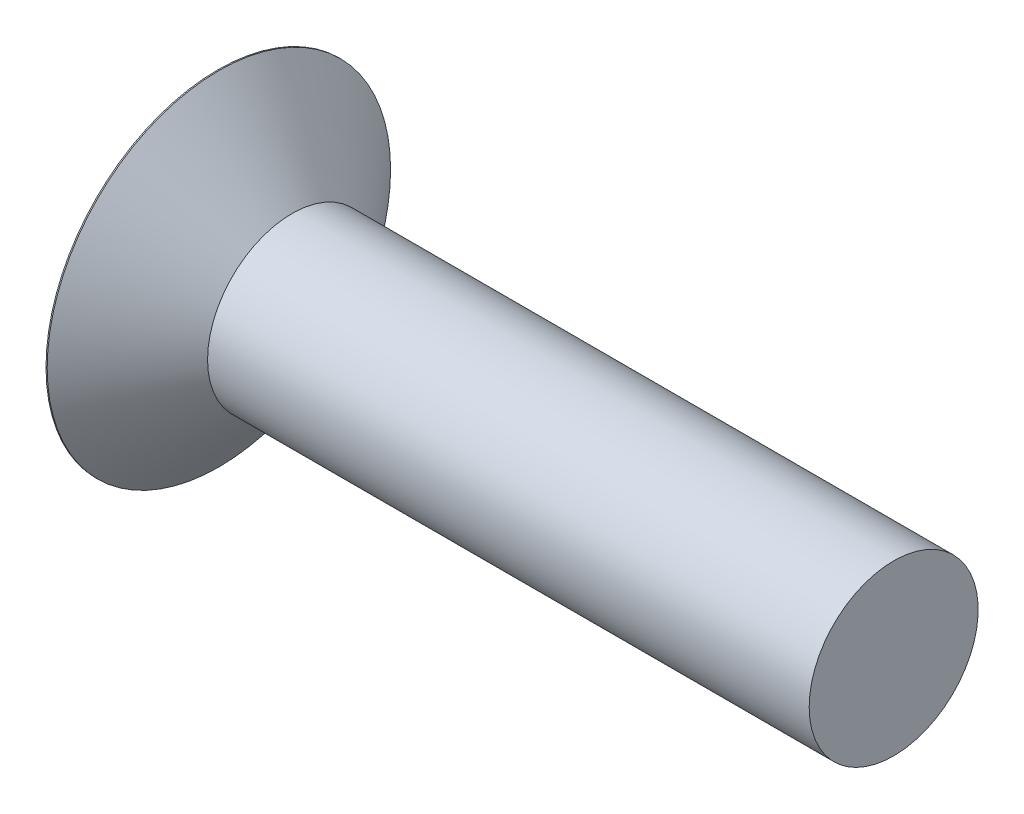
ISO-10303-21;
HEADER;
FILE_DESCRIPTION(('STEP AP214'),'2;1');
FILE_NAME('part.step','',(''),(''),'','','');
FILE_SCHEMA(('AUTOMOTIVE_DESIGN { 1 0 10303 214 1 1 1 1 }'));
ENDSEC;
DATA;
#1=APPLICATION_CONTEXT('core data for automotive mechanical design processes');
#2=APPLICATION_PROTOCOL_DEFINITION('international standard','automotive_design',2000,#1);
#3=PRODUCT_CONTEXT('',#1,'mechanical');
#4=PRODUCT('Part','Part','',(#3));
#5=PRODUCT_RELATED_PRODUCT_CATEGORY('part','',(#4));
#6=PRODUCT_DEFINITION_FORMATION('','',#4);
#7=PRODUCT_DEFINITION_CONTEXT('part definition',#1,'design');
#8=PRODUCT_DEFINITION('design','',#6,#7);
#9=PRODUCT_DEFINITION_SHAPE('','',#8);
#10=(LENGTH_UNIT() NAMED_UNIT(*) SI_UNIT(.MILLI.,.METRE.));
#11=(NAMED_UNIT(*) PLANE_ANGLE_UNIT() SI_UNIT($,.RADIAN.));
#12=(NAMED_UNIT(*) SI_UNIT($,.STERADIAN.) SOLID_ANGLE_UNIT());
#13=UNCERTAINTY_MEASURE_WITH_UNIT(LENGTH_MEASURE(1.E-05),#10,'distance_accuracy_value','');
#14=(GEOMETRIC_REPRESENTATION_CONTEXT(3) GLOBAL_UNCERTAINTY_ASSIGNED_CONTEXT((#13)) GLOBAL_UNIT_ASSIGNED_CONTEXT((#10,
#11,#12)) REPRESENTATION_CONTEXT('',''));
#15=CARTESIAN_POINT('',(0.,0.,0.));
#16=DIRECTION('',(0.,0.,1.));
#17=DIRECTION('',(1.,0.,0.));
#18=AXIS2_PLACEMENT_3D('',#15,#16,#17);
#19=CARTESIAN_POINT('',(0.,0.,0.));
#20=DIRECTION('',(-1.,0.,0.));
#21=DIRECTION('',(0.,0.,1.));
#22=AXIS2_PLACEMENT_3D('',#19,#20,#21);
#23=PLANE('',#22);
#24=CARTESIAN_POINT('',(0.,0.,0.));
#25=DIRECTION('',(-1.,0.,0.));
#26=DIRECTION('',(0.,0.,1.));
#27=AXIS2_PLACEMENT_3D('',#24,#25,#26);
#28=CIRCLE('',#27,9.6774);
#29=CARTESIAN_POINT('',(0.,0.,9.6774));
#30=VERTEX_POINT('',#29);
#31=EDGE_CURVE('E46',#30,#30,#28,.T.);
#32=ORIENTED_EDGE('',*,*,#31,.T.);
#33=EDGE_LOOP('',(#32));
#34=FACE_BOUND('',#33,.T.);
#35=DIRECTION('',(0.,1.,0.));
#36=VECTOR('',#35,1.);
#37=CARTESIAN_POINT('',(0.,-6.6421,-1.0922));
#38=LINE('',#37,#36);
#39=CARTESIAN_POINT('',(0.,-6.6421,-1.0922));
#40=VERTEX_POINT('',#39);
#41=CARTESIAN_POINT('',(0.,-1.0922,-1.0922));
#42=VERTEX_POINT('',#41);
#43=EDGE_CURVE('E107',#40,#42,#38,.T.);
#44=ORIENTED_EDGE('',*,*,#43,.T.);
#45=DIRECTION('',(0.,0.,-1.));
#46=VECTOR('',#45,1.);
#47=CARTESIAN_POINT('',(0.,-1.09220000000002,6.6421));
#48=LINE('',#47,#46);
#49=CARTESIAN_POINT('',(0.,-1.09219999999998,-6.6421));
#50=VERTEX_POINT('',#49);
#51=EDGE_CURVE('E87',#42,#50,#48,.T.);
#52=ORIENTED_EDGE('',*,*,#51,.T.);
#53=DIRECTION('',(0.,1.,0.));
#54=VECTOR('',#53,1.);
#55=CARTESIAN_POINT('',(0.,-1.09219999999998,-6.6421));
#56=LINE('',#55,#54);
#57=CARTESIAN_POINT('',(0.,1.09220000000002,-6.6421));
#58=VERTEX_POINT('',#57);
#59=EDGE_CURVE('E330',#50,#58,#56,.T.);
#60=ORIENTED_EDGE('',*,*,#59,.T.);
#61=DIRECTION('',(0.,0.,1.));
#62=VECTOR('',#61,1.);
#63=CARTESIAN_POINT('',(0.,1.09220000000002,-6.6421));
#64=LINE('',#63,#62);
#65=CARTESIAN_POINT('',(0.,1.0922,-1.0922));
#66=VERTEX_POINT('',#65);
#67=EDGE_CURVE('E103',#58,#66,#64,.T.);
#68=ORIENTED_EDGE('',*,*,#67,.T.);
#69=CARTESIAN_POINT('',(0.,6.6421,-1.0922));
#70=VERTEX_POINT('',#69);
#71=EDGE_CURVE('E97',#66,#70,#38,.T.);
#72=ORIENTED_EDGE('',*,*,#71,.T.);
#73=DIRECTION('',(0.,0.,1.));
#74=VECTOR('',#73,1.);
#75=CARTESIAN_POINT('',(0.,6.6421,-1.0922));
#76=LINE('',#75,#74);
#77=CARTESIAN_POINT('',(0.,6.6421,1.0922));
#78=VERTEX_POINT('',#77);
#79=EDGE_CURVE('E100',#70,#78,#76,.T.);
#80=ORIENTED_EDGE('',*,*,#79,.T.);
#81=DIRECTION('',(0.,-1.,0.));
#82=VECTOR('',#81,1.);
#83=CARTESIAN_POINT('',(0.,6.6421,1.0922));
#84=LINE('',#83,#82);
#85=CARTESIAN_POINT('',(0.,1.0922,1.0922));
#86=VERTEX_POINT('',#85);
#87=EDGE_CURVE('E342',#78,#86,#84,.T.);
#88=ORIENTED_EDGE('',*,*,#87,.T.);
#89=CARTESIAN_POINT('',(0.,1.09219999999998,6.6421));
#90=VERTEX_POINT('',#89);
#91=EDGE_CURVE('E325',#86,#90,#64,.T.);
#92=ORIENTED_EDGE('',*,*,#91,.T.);
#93=DIRECTION('',(0.,-1.,0.));
#94=VECTOR('',#93,1.);
#95=CARTESIAN_POINT('',(0.,1.09219999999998,6.6421));
#96=LINE('',#95,#94);
#97=CARTESIAN_POINT('',(0.,-1.09220000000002,6.6421));
#98=VERTEX_POINT('',#97);
#99=EDGE_CURVE('E311',#90,#98,#96,.T.);
#100=ORIENTED_EDGE('',*,*,#99,.T.);
#101=CARTESIAN_POINT('',(0.,-1.0922,1.0922));
#102=VERTEX_POINT('',#101);
#103=EDGE_CURVE('E323',#98,#102,#48,.T.);
#104=ORIENTED_EDGE('',*,*,#103,.T.);
#105=CARTESIAN_POINT('',(0.,-6.6421,1.0922));
#106=VERTEX_POINT('',#105);
#107=EDGE_CURVE('E113',#102,#106,#84,.T.);
#108=ORIENTED_EDGE('',*,*,#107,.T.);
#109=DIRECTION('',(0.,0.,-1.));
#110=VECTOR('',#109,1.);
#111=CARTESIAN_POINT('',(0.,-6.6421,1.0922));
#112=LINE('',#111,#110);
#113=EDGE_CURVE('E136',#106,#40,#112,.T.);
#114=ORIENTED_EDGE('',*,*,#113,.T.);
#115=EDGE_LOOP('',(#44,#52,#60,#68,#72,#80,#88,#92,#100,#104,#108,#114));
#116=FACE_BOUND('',#115,.T.);
#117=ADVANCED_FACE('F39',(#34,#116),#23,.T.);
#118=CARTESIAN_POINT('',(8.69008083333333,0.,0.497178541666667));
#119=DIRECTION('',(-0.0683113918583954,0.,-0.997664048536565));
#120=DIRECTION('',(-0.997664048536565,0.,0.0683113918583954));
#121=AXIS2_PLACEMENT_3D('',#118,#119,#120);
#122=PLANE('',#121);
#123=ORIENTED_EDGE('',*,*,#107,.F.);
#124=DIRECTION('',(0.995344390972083,0.0681525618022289,-0.0681525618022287));
#125=VECTOR('',#124,1.);
#126=CARTESIAN_POINT('',(8.72380707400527,-0.494869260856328,0.494869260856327));
#127=LINE('',#126,#125);
#128=CARTESIAN_POINT('',(7.9756,-0.546100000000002,0.546099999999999));
#129=VERTEX_POINT('',#128);
#130=EDGE_CURVE('E131',#102,#129,#127,.T.);
#131=ORIENTED_EDGE('',*,*,#130,.T.);
#132=DIRECTION('',(0.793328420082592,0.606365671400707,-0.0543202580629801));
#133=VECTOR('',#132,1.);
#134=CARTESIAN_POINT('',(0.,-6.6421,1.0922));
#135=LINE('',#134,#133);
#136=EDGE_CURVE('E108',#106,#129,#135,.T.);
#137=ORIENTED_EDGE('',*,*,#136,.F.);
#138=EDGE_LOOP('',(#123,#131,#137));
#139=FACE_BOUND('',#138,.T.);
#140=ADVANCED_FACE('F159',(#139),#122,.T.);
#141=DIRECTION('',(0.793328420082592,-0.606365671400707,-0.05432025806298));
#142=VECTOR('',#141,1.);
#143=CARTESIAN_POINT('',(0.,6.6421,1.0922));
#144=LINE('',#143,#142);
#145=CARTESIAN_POINT('',(7.9756,0.546100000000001,0.5461));
#146=VERTEX_POINT('',#145);
#147=EDGE_CURVE('E53',#78,#146,#144,.T.);
#148=ORIENTED_EDGE('',*,*,#147,.T.);
#149=DIRECTION('',(-0.995344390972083,0.0681525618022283,0.0681525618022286));
#150=VECTOR('',#149,1.);
#151=CARTESIAN_POINT('',(8.72380707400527,0.494869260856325,0.494869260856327));
#152=LINE('',#151,#150);
#153=EDGE_CURVE('E338',#146,#86,#152,.T.);
#154=ORIENTED_EDGE('',*,*,#153,.T.);
#155=ORIENTED_EDGE('',*,*,#87,.F.);
#156=EDGE_LOOP('',(#148,#154,#155));
#157=FACE_BOUND('',#156,.T.);
#158=ADVANCED_FACE('F164',(#157),#122,.T.);
#159=CARTESIAN_POINT('',(8.69008083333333,0.,-0.497178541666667));
#160=DIRECTION('',(-0.0683113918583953,0.,0.997664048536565));
#161=DIRECTION('',(0.997664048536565,0.,0.0683113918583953));
#162=AXIS2_PLACEMENT_3D('',#159,#160,#161);
#163=PLANE('',#162);
#164=DIRECTION('',(0.793328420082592,0.606365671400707,0.0543202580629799));
#165=VECTOR('',#164,1.);
#166=CARTESIAN_POINT('',(0.,-6.6421,-1.0922));
#167=LINE('',#166,#165);
#168=CARTESIAN_POINT('',(7.9756,-0.546099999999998,-0.546100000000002));
#169=VERTEX_POINT('',#168);
#170=EDGE_CURVE('E62',#40,#169,#167,.T.);
#171=ORIENTED_EDGE('',*,*,#170,.T.);
#172=DIRECTION('',(-0.995344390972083,-0.0681525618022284,-0.0681525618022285));
#173=VECTOR('',#172,1.);
#174=CARTESIAN_POINT('',(8.72380707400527,-0.494869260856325,-0.494869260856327));
#175=LINE('',#174,#173);
#176=EDGE_CURVE('E11',#169,#42,#175,.T.);
#177=ORIENTED_EDGE('',*,*,#176,.T.);
#178=ORIENTED_EDGE('',*,*,#43,.F.);
#179=EDGE_LOOP('',(#171,#177,#178));
#180=FACE_BOUND('',#179,.T.);
#181=ADVANCED_FACE('F156',(#180),#163,.T.);
#182=ORIENTED_EDGE('',*,*,#71,.F.);
#183=DIRECTION('',(0.995344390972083,-0.0681525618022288,0.0681525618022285));
#184=VECTOR('',#183,1.);
#185=CARTESIAN_POINT('',(8.72380707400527,0.494869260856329,-0.494869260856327));
#186=LINE('',#185,#184);
#187=CARTESIAN_POINT('',(7.9756,0.546100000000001,-0.5461));
#188=VERTEX_POINT('',#187);
#189=EDGE_CURVE('E116',#66,#188,#186,.T.);
#190=ORIENTED_EDGE('',*,*,#189,.T.);
#191=DIRECTION('',(0.793328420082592,-0.606365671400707,0.0543202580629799));
#192=VECTOR('',#191,1.);
#193=CARTESIAN_POINT('',(0.,6.6421,-1.0922));
#194=LINE('',#193,#192);
#195=EDGE_CURVE('E112',#70,#188,#194,.T.);
#196=ORIENTED_EDGE('',*,*,#195,.F.);
#197=EDGE_LOOP('',(#182,#190,#196));
#198=FACE_BOUND('',#197,.T.);
#199=ADVANCED_FACE('F115',(#198),#163,.T.);
#200=CARTESIAN_POINT('',(-6.34999999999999,0.,0.));
#201=DIRECTION('',(-1.,0.,0.));
#202=DIRECTION('',(0.,0.,1.));
#203=AXIS2_PLACEMENT_3D('',#200,#201,#202);
#204=CYLINDRICAL_SURFACE('',#203,9.6774);
#205=CARTESIAN_POINT('',(0.0669092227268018,0.,0.));
#206=DIRECTION('',(-1.,0.,0.));
#207=DIRECTION('',(0.,0.,1.));
#208=AXIS2_PLACEMENT_3D('',#205,#206,#207);
#209=CIRCLE('',#208,9.6774);
#210=CARTESIAN_POINT('',(0.0669092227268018,0.,9.6774));
#211=VERTEX_POINT('',#210);
#212=EDGE_CURVE('E139',#211,#211,#209,.T.);
#213=ORIENTED_EDGE('',*,*,#212,.T.);
#214=EDGE_LOOP('',(#213));
#215=FACE_BOUND('',#214,.T.);
#216=ORIENTED_EDGE('',*,*,#31,.F.);
#217=EDGE_LOOP('',(#216));
#218=FACE_BOUND('',#217,.T.);
#219=ADVANCED_FACE('F145',(#215,#218),#204,.T.);
#220=CARTESIAN_POINT('',(0.0669092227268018,0.,0.));
#221=DIRECTION('',(-1.,0.,0.));
#222=DIRECTION('',(0.,0.,1.));
#223=AXIS2_PLACEMENT_3D('',#220,#221,#222);
#224=CONICAL_SURFACE('',#223,9.6774,0.872664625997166);
#225=CARTESIAN_POINT('',(4.191,0.,0.));
#226=DIRECTION('',(-1.,0.,0.));
#227=DIRECTION('',(0.,0.,1.));
#228=AXIS2_PLACEMENT_3D('',#225,#226,#227);
#229=CIRCLE('',#228,4.7625);
#230=CARTESIAN_POINT('',(4.191,0.,4.7625));
#231=VERTEX_POINT('',#230);
#232=EDGE_CURVE('E135',#231,#231,#229,.T.);
#233=ORIENTED_EDGE('',*,*,#232,.T.);
#234=EDGE_LOOP('',(#233));
#235=FACE_BOUND('',#234,.T.);
#236=ORIENTED_EDGE('',*,*,#212,.F.);
#237=EDGE_LOOP('',(#236));
#238=FACE_BOUND('',#237,.T.);
#239=ADVANCED_FACE('F147',(#235,#238),#224,.T.);
#240=CARTESIAN_POINT('',(-6.34999999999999,0.,0.));
#241=DIRECTION('',(-1.,0.,0.));
#242=DIRECTION('',(0.,0.,1.));
#243=AXIS2_PLACEMENT_3D('',#240,#241,#242);
#244=CYLINDRICAL_SURFACE('',#243,4.7625);
#245=CARTESIAN_POINT('',(38.1,0.,0.));
#246=DIRECTION('',(-1.,0.,0.));
#247=DIRECTION('',(0.,0.,1.));
#248=AXIS2_PLACEMENT_3D('',#245,#246,#247);
#249=CIRCLE('',#248,4.7625);
#250=CARTESIAN_POINT('',(38.1,0.,4.7625));
#251=VERTEX_POINT('',#250);
#252=EDGE_CURVE('E132',#251,#251,#249,.T.);
#253=ORIENTED_EDGE('',*,*,#252,.T.);
#254=EDGE_LOOP('',(#253));
#255=FACE_BOUND('',#254,.T.);
#256=ORIENTED_EDGE('',*,*,#232,.F.);
#257=EDGE_LOOP('',(#256));
#258=FACE_BOUND('',#257,.T.);
#259=ADVANCED_FACE('F152',(#255,#258),#244,.T.);
#260=CARTESIAN_POINT('',(38.1,4.7625,0.));
#261=DIRECTION('',(1.,0.,0.));
#262=DIRECTION('',(0.,0.,-1.));
#263=AXIS2_PLACEMENT_3D('',#260,#261,#262);
#264=PLANE('',#263);
#265=ORIENTED_EDGE('',*,*,#252,.F.);
#266=EDGE_LOOP('',(#265));
#267=FACE_BOUND('',#266,.T.);
#268=ADVANCED_FACE('F184',(#267),#264,.T.);
#269=CARTESIAN_POINT('',(7.9756,0.5461,-0.5461));
#270=DIRECTION('',(1.,0.,0.));
#271=DIRECTION('',(0.,0.,-1.));
#272=AXIS2_PLACEMENT_3D('',#269,#270,#271);
#273=PLANE('',#272);
#274=DIRECTION('',(0.,1.,0.));
#275=VECTOR('',#274,1.);
#276=CARTESIAN_POINT('',(7.9756,-0.5461,-0.5461));
#277=LINE('',#276,#275);
#278=EDGE_CURVE('E127',#169,#188,#277,.T.);
#279=ORIENTED_EDGE('',*,*,#278,.F.);
#280=DIRECTION('',(0.,0.,-1.));
#281=VECTOR('',#280,1.);
#282=CARTESIAN_POINT('',(7.9756,-0.5461,0.5461));
#283=LINE('',#282,#281);
#284=EDGE_CURVE('E118',#129,#169,#283,.T.);
#285=ORIENTED_EDGE('',*,*,#284,.F.);
#286=DIRECTION('',(0.,-1.,0.));
#287=VECTOR('',#286,1.);
#288=CARTESIAN_POINT('',(7.9756,0.5461,0.5461));
#289=LINE('',#288,#287);
#290=EDGE_CURVE('E121',#146,#129,#289,.T.);
#291=ORIENTED_EDGE('',*,*,#290,.F.);
#292=DIRECTION('',(0.,0.,1.));
#293=VECTOR('',#292,1.);
#294=CARTESIAN_POINT('',(7.9756,0.5461,-0.5461));
#295=LINE('',#294,#293);
#296=EDGE_CURVE('E125',#188,#146,#295,.T.);
#297=ORIENTED_EDGE('',*,*,#296,.F.);
#298=EDGE_LOOP('',(#279,#285,#291,#297));
#299=FACE_BOUND('',#298,.T.);
#300=ADVANCED_FACE('F181',(#299),#273,.F.);
#301=CARTESIAN_POINT('',(7.9756,-0.5461,-0.5461));
#302=DIRECTION('',(-0.607262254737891,0.794501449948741,0.));
#303=DIRECTION('',(-0.794501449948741,-0.607262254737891,0.));
#304=AXIS2_PLACEMENT_3D('',#301,#302,#303);
#305=PLANE('',#304);
#306=ORIENTED_EDGE('',*,*,#170,.F.);
#307=ORIENTED_EDGE('',*,*,#113,.F.);
#308=ORIENTED_EDGE('',*,*,#136,.T.);
#309=ORIENTED_EDGE('',*,*,#284,.T.);
#310=EDGE_LOOP('',(#306,#307,#308,#309));
#311=FACE_BOUND('',#310,.T.);
#312=ADVANCED_FACE('F173',(#311),#305,.T.);
#313=CARTESIAN_POINT('',(7.9756,0.5461,0.5461));
#314=DIRECTION('',(-0.607262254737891,-0.794501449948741,0.));
#315=DIRECTION('',(0.794501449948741,-0.607262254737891,0.));
#316=AXIS2_PLACEMENT_3D('',#313,#314,#315);
#317=PLANE('',#316);
#318=ORIENTED_EDGE('',*,*,#147,.F.);
#319=ORIENTED_EDGE('',*,*,#79,.F.);
#320=ORIENTED_EDGE('',*,*,#195,.T.);
#321=ORIENTED_EDGE('',*,*,#296,.T.);
#322=EDGE_LOOP('',(#318,#319,#320,#321));
#323=FACE_BOUND('',#322,.T.);
#324=ADVANCED_FACE('F111',(#323),#317,.T.);
#325=CARTESIAN_POINT('',(8.69008083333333,-0.497178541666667,0.));
#326=DIRECTION('',(-0.0683113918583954,0.997664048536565,0.));
#327=DIRECTION('',(-0.997664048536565,-0.0683113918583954,0.));
#328=AXIS2_PLACEMENT_3D('',#325,#326,#327);
#329=PLANE('',#328);
#330=DIRECTION('',(0.793328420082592,0.054320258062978,0.606365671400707));
#331=VECTOR('',#330,1.);
#332=CARTESIAN_POINT('',(0.,-1.09219999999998,-6.6421));
#333=LINE('',#332,#331);
#334=EDGE_CURVE('E332',#50,#169,#333,.T.);
#335=ORIENTED_EDGE('',*,*,#334,.F.);
#336=ORIENTED_EDGE('',*,*,#51,.F.);
#337=ORIENTED_EDGE('',*,*,#176,.F.);
#338=EDGE_LOOP('',(#335,#336,#337));
#339=FACE_BOUND('',#338,.T.);
#340=ADVANCED_FACE('F180',(#339),#329,.T.);
#341=CARTESIAN_POINT('',(8.69008083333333,0.497178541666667,0.));
#342=DIRECTION('',(-0.0683113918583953,-0.997664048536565,0.));
#343=DIRECTION('',(0.997664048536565,-0.0683113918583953,0.));
#344=AXIS2_PLACEMENT_3D('',#341,#342,#343);
#345=PLANE('',#344);
#346=ORIENTED_EDGE('',*,*,#67,.F.);
#347=DIRECTION('',(0.793328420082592,-0.0543202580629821,0.606365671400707));
#348=VECTOR('',#347,1.);
#349=CARTESIAN_POINT('',(0.,1.09220000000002,-6.6421));
#350=LINE('',#349,#348);
#351=EDGE_CURVE('E78',#58,#188,#350,.T.);
#352=ORIENTED_EDGE('',*,*,#351,.T.);
#353=ORIENTED_EDGE('',*,*,#189,.F.);
#354=EDGE_LOOP('',(#346,#352,#353));
#355=FACE_BOUND('',#354,.T.);
#356=ADVANCED_FACE('F256',(#355),#345,.T.);
#357=CARTESIAN_POINT('',(7.9756,0.546100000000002,-0.546099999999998));
#358=DIRECTION('',(-0.607262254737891,0.,0.794501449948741));
#359=DIRECTION('',(-0.794501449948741,0.,-0.607262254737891));
#360=AXIS2_PLACEMENT_3D('',#357,#358,#359);
#361=PLANE('',#360);
#362=ORIENTED_EDGE('',*,*,#351,.F.);
#363=ORIENTED_EDGE('',*,*,#59,.F.);
#364=ORIENTED_EDGE('',*,*,#334,.T.);
#365=ORIENTED_EDGE('',*,*,#278,.T.);
#366=EDGE_LOOP('',(#362,#363,#364,#365));
#367=FACE_BOUND('',#366,.T.);
#368=ADVANCED_FACE('F266',(#367),#361,.T.);
#369=ORIENTED_EDGE('',*,*,#103,.F.);
#370=DIRECTION('',(0.793328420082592,0.0543202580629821,-0.606365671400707));
#371=VECTOR('',#370,1.);
#372=CARTESIAN_POINT('',(0.,-1.09220000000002,6.6421));
#373=LINE('',#372,#371);
#374=EDGE_CURVE('E308',#98,#129,#373,.T.);
#375=ORIENTED_EDGE('',*,*,#374,.T.);
#376=ORIENTED_EDGE('',*,*,#130,.F.);
#377=EDGE_LOOP('',(#369,#375,#376));
#378=FACE_BOUND('',#377,.T.);
#379=ADVANCED_FACE('F258',(#378),#329,.T.);
#380=DIRECTION('',(0.793328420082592,-0.0543202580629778,-0.606365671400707));
#381=VECTOR('',#380,1.);
#382=CARTESIAN_POINT('',(0.,1.09219999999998,6.6421));
#383=LINE('',#382,#381);
#384=EDGE_CURVE('E319',#90,#146,#383,.T.);
#385=ORIENTED_EDGE('',*,*,#384,.F.);
#386=ORIENTED_EDGE('',*,*,#91,.F.);
#387=ORIENTED_EDGE('',*,*,#153,.F.);
#388=EDGE_LOOP('',(#385,#386,#387));
#389=FACE_BOUND('',#388,.T.);
#390=ADVANCED_FACE('F268',(#389),#345,.T.);
#391=CARTESIAN_POINT('',(7.9756,-0.546100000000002,0.546099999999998));
#392=DIRECTION('',(-0.607262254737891,0.,-0.794501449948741));
#393=DIRECTION('',(0.794501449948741,0.,-0.607262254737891));
#394=AXIS2_PLACEMENT_3D('',#391,#392,#393);
#395=PLANE('',#394);
#396=ORIENTED_EDGE('',*,*,#374,.F.);
#397=ORIENTED_EDGE('',*,*,#99,.F.);
#398=ORIENTED_EDGE('',*,*,#384,.T.);
#399=ORIENTED_EDGE('',*,*,#290,.T.);
#400=EDGE_LOOP('',(#396,#397,#398,#399));
#401=FACE_BOUND('',#400,.T.);
#402=ADVANCED_FACE('F293',(#401),#395,.T.);
#403=CLOSED_SHELL('',(#117,#140,#158,#181,#199,#219,#239,#259,#268,#300,#312,#324,#340,#356,
#368,#379,#390,#402));
#404=MANIFOLD_SOLID_BREP('B2',#403);
#405=ADVANCED_BREP_SHAPE_REPRESENTATION('',(#18,#404),#14);
#406=SHAPE_DEFINITION_REPRESENTATION(#9,#405);
ENDSEC;
END-ISO-10303-21;
